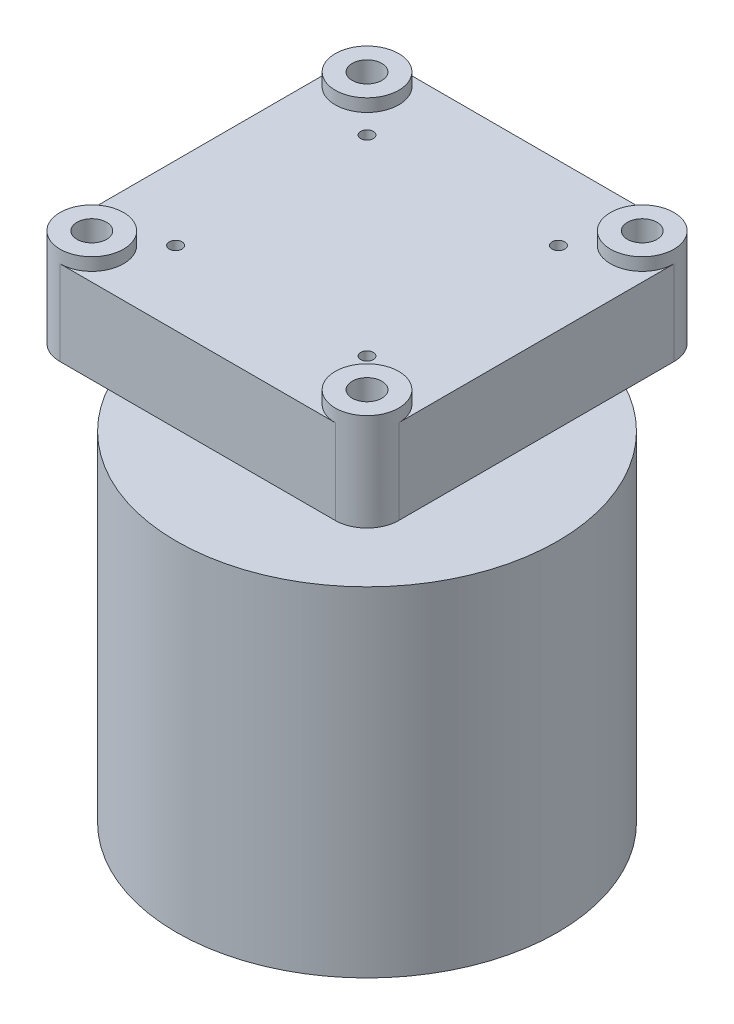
from build123d import *

# Parameters (mm, degrees)
SKETCH1_R           = 3.5
SKETCH1_R_2         = 1.5
BOSS_EXTRUDE1_DEPTH = 20
SKETCH2_R           = 17.5
BOSS_EXTRUDE2_DEPTH = 18
SKETCH3_R           = 45
BOSS_EXTRUDE3_DEPTH = 80
SKETCH4_R           = 7.5
SKETCH4_R_2         = 3.5
BOSS_EXTRUDE5_DEPTH = 3


with BuildPart() as part:
    # Sketch1 → Boss-Extrude1 (new body)
    with BuildSketch(Plane(origin=(0, 0, 0), x_dir=(1, 0, 0), z_dir=(0, 1, 0))):
        with BuildLine():
            Line((-32.5, -40), (32.5, -40))
            ThreePointArc((32.5, -40), (37.803300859, -37.803300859), (40, -32.5))
            Line((40, -32.5), (40, 32.5))
            ThreePointArc((40, 32.5), (37.803300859, 37.803300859), (32.5, 40))
            Line((32.5, 40), (-32.5, 40))
            ThreePointArc((-32.5, 40), (-37.803300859, 37.803300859), (-40, 32.5))
            Line((-40, 32.5), (-40, -32.5))
            ThreePointArc((-40, -32.5), (-37.803300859, -37.803300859), (-32.5, -40))
        make_face()
        with Locations(Location((32.5, 32.5, 0), (0, 0, 270))):
            Circle(SKETCH1_R, mode=Mode.SUBTRACT)
        with Locations(Location((-32.5, -32.5, 0), (0, 0, 90))):
            Circle(SKETCH1_R, mode=Mode.SUBTRACT)
        with Locations(Location((-32.5, 32.5, 0), (0, 0, 90))):
            Circle(SKETCH1_R, mode=Mode.SUBTRACT)
        with Locations(Location((32.5, -32.5, 0), (0, 0, 270))):
            Circle(SKETCH1_R, mode=Mode.SUBTRACT)
        with Locations(Location((22.600505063, -22.600505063, 0), (0, 0, 270))):
            Circle(SKETCH1_R_2, mode=Mode.SUBTRACT)
        with Locations(Location((-22.600505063, -22.600505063, 0), (0, 0, 90))):
            Circle(SKETCH1_R_2, mode=Mode.SUBTRACT)
        with Locations(Location((-22.600505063, 22.600505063, 0), (0, 0, 270))):
            Circle(SKETCH1_R_2, mode=Mode.SUBTRACT)
        with Locations(Location((22.600505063, 22.600505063, 0), (0, 0, 90))):
            Circle(SKETCH1_R_2, mode=Mode.SUBTRACT)
    extrude(amount=BOSS_EXTRUDE1_DEPTH)

    # Sketch2 → Boss-Extrude2 (add)
    with BuildSketch(Plane.XZ):
        with Locations(Location((0, 0, 0), (0, 0, 270))):
            Circle(SKETCH2_R)
    extrude(amount=BOSS_EXTRUDE2_DEPTH)

    # Sketch3 → Boss-Extrude3 (add)
    with BuildSketch(Plane.XZ.offset(18)):
        with Locations(Location((0, 0, 0), (0, 0, 270))):
            Circle(SKETCH3_R)
    extrude(amount=BOSS_EXTRUDE3_DEPTH)

    # Sketch4 → Boss-Extrude5 (add)
    # profile 1 of 4: a face of its own
    with BuildSketch(Plane(origin=(0, 20, 0), x_dir=(1, 0, 0), z_dir=(0, 1, 0))):
        with Locations(Location((32.5, 32.5, 0), (0, 0, 90))):
            Circle(SKETCH4_R)
        with Locations(Location((32.5, 32.5, 0), (0, 0, 270))):
            Circle(SKETCH4_R_2, mode=Mode.SUBTRACT)
    # profile 2 of 4: a face of its own
    with BuildSketch(Plane(origin=(0, 20, 0), x_dir=(1, 0, 0), z_dir=(0, 1, 0))):
        with Locations(Location((32.5, -32.5, 0), (0, 0, 90))):
            Circle(SKETCH4_R)
        with Locations(Location((32.5, -32.5, 0), (0, 0, 90))):
            Circle(SKETCH4_R_2, mode=Mode.SUBTRACT)
    # profile 3 of 4: a face of its own
    with BuildSketch(Plane(origin=(0, 20, 0), x_dir=(1, 0, 0), z_dir=(0, 1, 0))):
        with Locations(Location((-32.5, -32.5, 0), (0, 0, 270))):
            Circle(SKETCH4_R)
        with Locations(Location((-32.5, -32.5, 0), (0, 0, 90))):
            Circle(SKETCH4_R_2, mode=Mode.SUBTRACT)
    # profile 4 of 4: a face of its own
    with BuildSketch(Plane(origin=(0, 20, 0), x_dir=(1, 0, 0), z_dir=(0, 1, 0))):
        with Locations(Location((-32.5, 32.5, 0), (0, 0, 90))):
            Circle(SKETCH4_R)
        with Locations(Location((-32.5, 32.5, 0), (0, 0, 90))):
            Circle(SKETCH4_R_2, mode=Mode.SUBTRACT)
    extrude(amount=BOSS_EXTRUDE5_DEPTH)


solid = part.part
